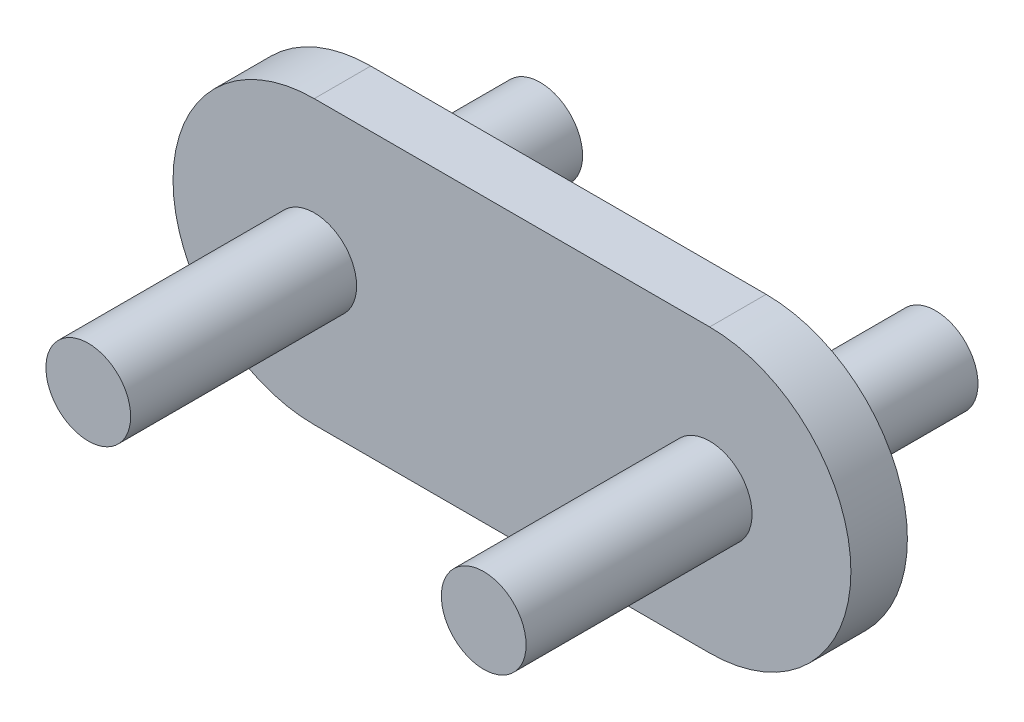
ISO-10303-21;
HEADER;
FILE_DESCRIPTION(('STEP AP214'),'2;1');
FILE_NAME('part.step','',(''),(''),'','','');
FILE_SCHEMA(('AUTOMOTIVE_DESIGN { 1 0 10303 214 1 1 1 1 }'));
ENDSEC;
DATA;
#1=APPLICATION_CONTEXT('core data for automotive mechanical design processes');
#2=APPLICATION_PROTOCOL_DEFINITION('international standard','automotive_design',2000,#1);
#3=PRODUCT_CONTEXT('',#1,'mechanical');
#4=PRODUCT('Part','Part','',(#3));
#5=PRODUCT_RELATED_PRODUCT_CATEGORY('part','',(#4));
#6=PRODUCT_DEFINITION_FORMATION('','',#4);
#7=PRODUCT_DEFINITION_CONTEXT('part definition',#1,'design');
#8=PRODUCT_DEFINITION('design','',#6,#7);
#9=PRODUCT_DEFINITION_SHAPE('','',#8);
#10=(LENGTH_UNIT() NAMED_UNIT(*) SI_UNIT(.MILLI.,.METRE.));
#11=(NAMED_UNIT(*) PLANE_ANGLE_UNIT() SI_UNIT($,.RADIAN.));
#12=(NAMED_UNIT(*) SI_UNIT($,.STERADIAN.) SOLID_ANGLE_UNIT());
#13=UNCERTAINTY_MEASURE_WITH_UNIT(LENGTH_MEASURE(1.E-05),#10,'distance_accuracy_value','');
#14=(GEOMETRIC_REPRESENTATION_CONTEXT(3) GLOBAL_UNCERTAINTY_ASSIGNED_CONTEXT((#13)) GLOBAL_UNIT_ASSIGNED_CONTEXT((#10,
#11,#12)) REPRESENTATION_CONTEXT('',''));
#15=CARTESIAN_POINT('',(0.,0.,0.));
#16=DIRECTION('',(0.,0.,1.));
#17=DIRECTION('',(1.,0.,0.));
#18=AXIS2_PLACEMENT_3D('',#15,#16,#17);
#19=CARTESIAN_POINT('',(0.,0.,10.));
#20=DIRECTION('',(0.,0.,1.));
#21=DIRECTION('',(1.,0.,0.));
#22=AXIS2_PLACEMENT_3D('',#19,#20,#21);
#23=PLANE('',#22);
#24=CARTESIAN_POINT('',(-70.,0.,10.));
#25=DIRECTION('',(0.,0.,1.));
#26=DIRECTION('',(1.,0.,0.));
#27=AXIS2_PLACEMENT_3D('',#24,#25,#26);
#28=CIRCLE('',#27,7.50000000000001);
#29=CARTESIAN_POINT('',(-62.5,0.,10.));
#30=VERTEX_POINT('',#29);
#31=EDGE_CURVE('E92',#30,#30,#28,.T.);
#32=ORIENTED_EDGE('',*,*,#31,.F.);
#33=EDGE_LOOP('',(#32));
#34=FACE_BOUND('',#33,.T.);
#35=CARTESIAN_POINT('',(0.,0.,10.));
#36=DIRECTION('',(0.,0.,1.));
#37=DIRECTION('',(1.,0.,0.));
#38=AXIS2_PLACEMENT_3D('',#35,#36,#37);
#39=CIRCLE('',#38,25.);
#40=CARTESIAN_POINT('',(0.,-25.,10.));
#41=VERTEX_POINT('',#40);
#42=CARTESIAN_POINT('',(0.,25.,10.));
#43=VERTEX_POINT('',#42);
#44=EDGE_CURVE('E102',#41,#43,#39,.T.);
#45=ORIENTED_EDGE('',*,*,#44,.T.);
#46=DIRECTION('',(-1.,0.,0.));
#47=VECTOR('',#46,1.);
#48=CARTESIAN_POINT('',(0.,25.,10.));
#49=LINE('',#48,#47);
#50=CARTESIAN_POINT('',(-70.,25.,10.));
#51=VERTEX_POINT('',#50);
#52=EDGE_CURVE('E87',#43,#51,#49,.T.);
#53=ORIENTED_EDGE('',*,*,#52,.T.);
#54=CARTESIAN_POINT('',(-70.,0.,10.));
#55=DIRECTION('',(0.,0.,1.));
#56=DIRECTION('',(1.,0.,0.));
#57=AXIS2_PLACEMENT_3D('',#54,#55,#56);
#58=CIRCLE('',#57,25.);
#59=CARTESIAN_POINT('',(-70.,-25.,10.));
#60=VERTEX_POINT('',#59);
#61=EDGE_CURVE('E53',#51,#60,#58,.T.);
#62=ORIENTED_EDGE('',*,*,#61,.T.);
#63=DIRECTION('',(1.,0.,0.));
#64=VECTOR('',#63,1.);
#65=CARTESIAN_POINT('',(-70.,-25.,10.));
#66=LINE('',#65,#64);
#67=EDGE_CURVE('E48',#60,#41,#66,.T.);
#68=ORIENTED_EDGE('',*,*,#67,.T.);
#69=EDGE_LOOP('',(#45,#53,#62,#68));
#70=FACE_BOUND('',#69,.T.);
#71=CARTESIAN_POINT('',(0.,0.,10.));
#72=DIRECTION('',(0.,0.,1.));
#73=DIRECTION('',(1.,0.,0.));
#74=AXIS2_PLACEMENT_3D('',#71,#72,#73);
#75=CIRCLE('',#74,7.5);
#76=CARTESIAN_POINT('',(7.5,0.,10.));
#77=VERTEX_POINT('',#76);
#78=EDGE_CURVE('E95',#77,#77,#75,.T.);
#79=ORIENTED_EDGE('',*,*,#78,.F.);
#80=EDGE_LOOP('',(#79));
#81=FACE_BOUND('',#80,.T.);
#82=ADVANCED_FACE('F33',(#34,#70,#81),#23,.T.);
#83=CARTESIAN_POINT('',(0.,0.,0.));
#84=DIRECTION('',(0.,0.,1.));
#85=DIRECTION('',(1.,0.,0.));
#86=AXIS2_PLACEMENT_3D('',#83,#84,#85);
#87=PLANE('',#86);
#88=CARTESIAN_POINT('',(-70.,0.,0.));
#89=DIRECTION('',(0.,0.,1.));
#90=DIRECTION('',(1.,0.,0.));
#91=AXIS2_PLACEMENT_3D('',#88,#89,#90);
#92=CIRCLE('',#91,7.50000000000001);
#93=CARTESIAN_POINT('',(-62.5,0.,0.));
#94=VERTEX_POINT('',#93);
#95=EDGE_CURVE('E131',#94,#94,#92,.F.);
#96=ORIENTED_EDGE('',*,*,#95,.F.);
#97=EDGE_LOOP('',(#96));
#98=FACE_BOUND('',#97,.T.);
#99=CARTESIAN_POINT('',(0.,0.,0.));
#100=DIRECTION('',(0.,0.,1.));
#101=DIRECTION('',(1.,0.,0.));
#102=AXIS2_PLACEMENT_3D('',#99,#100,#101);
#103=CIRCLE('',#102,25.);
#104=CARTESIAN_POINT('',(0.,-25.,0.));
#105=VERTEX_POINT('',#104);
#106=CARTESIAN_POINT('',(0.,25.,0.));
#107=VERTEX_POINT('',#106);
#108=EDGE_CURVE('E79',#105,#107,#103,.T.);
#109=ORIENTED_EDGE('',*,*,#108,.F.);
#110=DIRECTION('',(1.,0.,0.));
#111=VECTOR('',#110,1.);
#112=CARTESIAN_POINT('',(-70.,-25.,0.));
#113=LINE('',#112,#111);
#114=CARTESIAN_POINT('',(-70.,-25.,0.));
#115=VERTEX_POINT('',#114);
#116=EDGE_CURVE('E100',#115,#105,#113,.T.);
#117=ORIENTED_EDGE('',*,*,#116,.F.);
#118=CARTESIAN_POINT('',(-70.,0.,0.));
#119=DIRECTION('',(0.,0.,1.));
#120=DIRECTION('',(1.,0.,0.));
#121=AXIS2_PLACEMENT_3D('',#118,#119,#120);
#122=CIRCLE('',#121,25.);
#123=CARTESIAN_POINT('',(-70.,25.,0.));
#124=VERTEX_POINT('',#123);
#125=EDGE_CURVE('E80',#124,#115,#122,.T.);
#126=ORIENTED_EDGE('',*,*,#125,.F.);
#127=DIRECTION('',(-1.,0.,0.));
#128=VECTOR('',#127,1.);
#129=CARTESIAN_POINT('',(0.,25.,0.));
#130=LINE('',#129,#128);
#131=EDGE_CURVE('E74',#107,#124,#130,.T.);
#132=ORIENTED_EDGE('',*,*,#131,.F.);
#133=EDGE_LOOP('',(#109,#117,#126,#132));
#134=FACE_BOUND('',#133,.T.);
#135=CARTESIAN_POINT('',(0.,0.,0.));
#136=DIRECTION('',(0.,0.,1.));
#137=DIRECTION('',(1.,0.,0.));
#138=AXIS2_PLACEMENT_3D('',#135,#136,#137);
#139=CIRCLE('',#138,7.5);
#140=CARTESIAN_POINT('',(7.5,0.,0.));
#141=VERTEX_POINT('',#140);
#142=EDGE_CURVE('E121',#141,#141,#139,.F.);
#143=ORIENTED_EDGE('',*,*,#142,.F.);
#144=EDGE_LOOP('',(#143));
#145=FACE_BOUND('',#144,.T.);
#146=ADVANCED_FACE('F75',(#98,#134,#145),#87,.F.);
#147=CARTESIAN_POINT('',(0.,0.,10.));
#148=DIRECTION('',(0.,0.,-1.));
#149=DIRECTION('',(-1.,0.,0.));
#150=AXIS2_PLACEMENT_3D('',#147,#148,#149);
#151=CYLINDRICAL_SURFACE('',#150,25.);
#152=ORIENTED_EDGE('',*,*,#108,.T.);
#153=DIRECTION('',(0.,0.,-1.));
#154=VECTOR('',#153,1.);
#155=CARTESIAN_POINT('',(0.,25.,10.));
#156=LINE('',#155,#154);
#157=EDGE_CURVE('E11',#43,#107,#156,.T.);
#158=ORIENTED_EDGE('',*,*,#157,.F.);
#159=ORIENTED_EDGE('',*,*,#44,.F.);
#160=DIRECTION('',(0.,0.,-1.));
#161=VECTOR('',#160,1.);
#162=CARTESIAN_POINT('',(0.,-25.,10.));
#163=LINE('',#162,#161);
#164=EDGE_CURVE('E91',#41,#105,#163,.T.);
#165=ORIENTED_EDGE('',*,*,#164,.T.);
#166=EDGE_LOOP('',(#152,#158,#159,#165));
#167=FACE_BOUND('',#166,.T.);
#168=ADVANCED_FACE('F35',(#167),#151,.T.);
#169=CARTESIAN_POINT('',(0.,25.,10.));
#170=DIRECTION('',(0.,-1.,0.));
#171=DIRECTION('',(1.,0.,0.));
#172=AXIS2_PLACEMENT_3D('',#169,#170,#171);
#173=PLANE('',#172);
#174=ORIENTED_EDGE('',*,*,#131,.T.);
#175=DIRECTION('',(0.,0.,-1.));
#176=VECTOR('',#175,1.);
#177=CARTESIAN_POINT('',(-70.,25.,10.));
#178=LINE('',#177,#176);
#179=EDGE_CURVE('E41',#51,#124,#178,.T.);
#180=ORIENTED_EDGE('',*,*,#179,.F.);
#181=ORIENTED_EDGE('',*,*,#52,.F.);
#182=ORIENTED_EDGE('',*,*,#157,.T.);
#183=EDGE_LOOP('',(#174,#180,#181,#182));
#184=FACE_BOUND('',#183,.T.);
#185=ADVANCED_FACE('F86',(#184),#173,.F.);
#186=CARTESIAN_POINT('',(-70.,0.,10.));
#187=DIRECTION('',(0.,0.,-1.));
#188=DIRECTION('',(-1.,0.,0.));
#189=AXIS2_PLACEMENT_3D('',#186,#187,#188);
#190=CYLINDRICAL_SURFACE('',#189,25.);
#191=ORIENTED_EDGE('',*,*,#125,.T.);
#192=DIRECTION('',(0.,0.,-1.));
#193=VECTOR('',#192,1.);
#194=CARTESIAN_POINT('',(-70.,-25.,10.));
#195=LINE('',#194,#193);
#196=EDGE_CURVE('E108',#60,#115,#195,.T.);
#197=ORIENTED_EDGE('',*,*,#196,.F.);
#198=ORIENTED_EDGE('',*,*,#61,.F.);
#199=ORIENTED_EDGE('',*,*,#179,.T.);
#200=EDGE_LOOP('',(#191,#197,#198,#199));
#201=FACE_BOUND('',#200,.T.);
#202=ADVANCED_FACE('F111',(#201),#190,.T.);
#203=CARTESIAN_POINT('',(-70.,-25.,10.));
#204=DIRECTION('',(0.,1.,0.));
#205=DIRECTION('',(0.,0.,1.));
#206=AXIS2_PLACEMENT_3D('',#203,#204,#205);
#207=PLANE('',#206);
#208=ORIENTED_EDGE('',*,*,#116,.T.);
#209=ORIENTED_EDGE('',*,*,#164,.F.);
#210=ORIENTED_EDGE('',*,*,#67,.F.);
#211=ORIENTED_EDGE('',*,*,#196,.T.);
#212=EDGE_LOOP('',(#208,#209,#210,#211));
#213=FACE_BOUND('',#212,.T.);
#214=ADVANCED_FACE('F113',(#213),#207,.F.);
#215=CARTESIAN_POINT('',(0.,0.,-30.));
#216=DIRECTION('',(0.,0.,1.));
#217=DIRECTION('',(1.,0.,0.));
#218=AXIS2_PLACEMENT_3D('',#215,#216,#217);
#219=PLANE('',#218);
#220=CARTESIAN_POINT('',(0.,0.,-30.));
#221=DIRECTION('',(0.,0.,1.));
#222=DIRECTION('',(1.,0.,0.));
#223=AXIS2_PLACEMENT_3D('',#220,#221,#222);
#224=CIRCLE('',#223,7.5);
#225=CARTESIAN_POINT('',(7.5,0.,-30.));
#226=VERTEX_POINT('',#225);
#227=EDGE_CURVE('E128',#226,#226,#224,.T.);
#228=ORIENTED_EDGE('',*,*,#227,.F.);
#229=EDGE_LOOP('',(#228));
#230=FACE_BOUND('',#229,.T.);
#231=ADVANCED_FACE('F164',(#230),#219,.F.);
#232=CARTESIAN_POINT('',(0.,0.,50.));
#233=DIRECTION('',(0.,0.,-1.));
#234=DIRECTION('',(-1.,0.,0.));
#235=AXIS2_PLACEMENT_3D('',#232,#233,#234);
#236=CYLINDRICAL_SURFACE('',#235,7.5);
#237=ORIENTED_EDGE('',*,*,#227,.T.);
#238=EDGE_LOOP('',(#237));
#239=FACE_BOUND('',#238,.T.);
#240=ORIENTED_EDGE('',*,*,#142,.T.);
#241=EDGE_LOOP('',(#240));
#242=FACE_BOUND('',#241,.T.);
#243=ADVANCED_FACE('F166',(#239,#242),#236,.T.);
#244=ORIENTED_EDGE('',*,*,#78,.T.);
#245=EDGE_LOOP('',(#244));
#246=FACE_BOUND('',#245,.T.);
#247=CARTESIAN_POINT('',(0.,0.,50.));
#248=DIRECTION('',(0.,0.,1.));
#249=DIRECTION('',(1.,0.,0.));
#250=AXIS2_PLACEMENT_3D('',#247,#248,#249);
#251=CIRCLE('',#250,7.5);
#252=CARTESIAN_POINT('',(7.5,0.,50.));
#253=VERTEX_POINT('',#252);
#254=EDGE_CURVE('E123',#253,#253,#251,.T.);
#255=ORIENTED_EDGE('',*,*,#254,.F.);
#256=EDGE_LOOP('',(#255));
#257=FACE_BOUND('',#256,.T.);
#258=ADVANCED_FACE('F154',(#246,#257),#236,.T.);
#259=CARTESIAN_POINT('',(0.,0.,50.));
#260=DIRECTION('',(0.,0.,1.));
#261=DIRECTION('',(1.,0.,0.));
#262=AXIS2_PLACEMENT_3D('',#259,#260,#261);
#263=PLANE('',#262);
#264=ORIENTED_EDGE('',*,*,#254,.T.);
#265=EDGE_LOOP('',(#264));
#266=FACE_BOUND('',#265,.T.);
#267=ADVANCED_FACE('F146',(#266),#263,.T.);
#268=CARTESIAN_POINT('',(-70.,0.,-30.));
#269=DIRECTION('',(0.,0.,1.));
#270=DIRECTION('',(1.,0.,0.));
#271=AXIS2_PLACEMENT_3D('',#268,#269,#270);
#272=PLANE('',#271);
#273=CARTESIAN_POINT('',(-70.,0.,-30.));
#274=DIRECTION('',(0.,0.,1.));
#275=DIRECTION('',(1.,0.,0.));
#276=AXIS2_PLACEMENT_3D('',#273,#274,#275);
#277=CIRCLE('',#276,7.50000000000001);
#278=CARTESIAN_POINT('',(-62.5,0.,-30.));
#279=VERTEX_POINT('',#278);
#280=EDGE_CURVE('E137',#279,#279,#277,.T.);
#281=ORIENTED_EDGE('',*,*,#280,.F.);
#282=EDGE_LOOP('',(#281));
#283=FACE_BOUND('',#282,.T.);
#284=ADVANCED_FACE('F144',(#283),#272,.F.);
#285=CARTESIAN_POINT('',(-70.,0.,50.));
#286=DIRECTION('',(0.,0.,-1.));
#287=DIRECTION('',(-1.,0.,0.));
#288=AXIS2_PLACEMENT_3D('',#285,#286,#287);
#289=CYLINDRICAL_SURFACE('',#288,7.50000000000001);
#290=ORIENTED_EDGE('',*,*,#280,.T.);
#291=EDGE_LOOP('',(#290));
#292=FACE_BOUND('',#291,.T.);
#293=ORIENTED_EDGE('',*,*,#95,.T.);
#294=EDGE_LOOP('',(#293));
#295=FACE_BOUND('',#294,.T.);
#296=ADVANCED_FACE('F141',(#292,#295),#289,.T.);
#297=ORIENTED_EDGE('',*,*,#31,.T.);
#298=EDGE_LOOP('',(#297));
#299=FACE_BOUND('',#298,.T.);
#300=CARTESIAN_POINT('',(-70.,0.,50.));
#301=DIRECTION('',(0.,0.,1.));
#302=DIRECTION('',(1.,0.,0.));
#303=AXIS2_PLACEMENT_3D('',#300,#301,#302);
#304=CIRCLE('',#303,7.50000000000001);
#305=CARTESIAN_POINT('',(-62.5,0.,50.));
#306=VERTEX_POINT('',#305);
#307=EDGE_CURVE('E134',#306,#306,#304,.T.);
#308=ORIENTED_EDGE('',*,*,#307,.F.);
#309=EDGE_LOOP('',(#308));
#310=FACE_BOUND('',#309,.T.);
#311=ADVANCED_FACE('F152',(#299,#310),#289,.T.);
#312=CARTESIAN_POINT('',(-70.,0.,50.));
#313=DIRECTION('',(0.,0.,1.));
#314=DIRECTION('',(1.,0.,0.));
#315=AXIS2_PLACEMENT_3D('',#312,#313,#314);
#316=PLANE('',#315);
#317=ORIENTED_EDGE('',*,*,#307,.T.);
#318=EDGE_LOOP('',(#317));
#319=FACE_BOUND('',#318,.T.);
#320=ADVANCED_FACE('F158',(#319),#316,.T.);
#321=CLOSED_SHELL('',(#82,#146,#168,#185,#202,#214,#231,#243,#258,#267,#284,#296,#311,#320));
#322=MANIFOLD_SOLID_BREP('B2',#321);
#323=ADVANCED_BREP_SHAPE_REPRESENTATION('',(#18,#322),#14);
#324=SHAPE_DEFINITION_REPRESENTATION(#9,#323);
ENDSEC;
END-ISO-10303-21;
